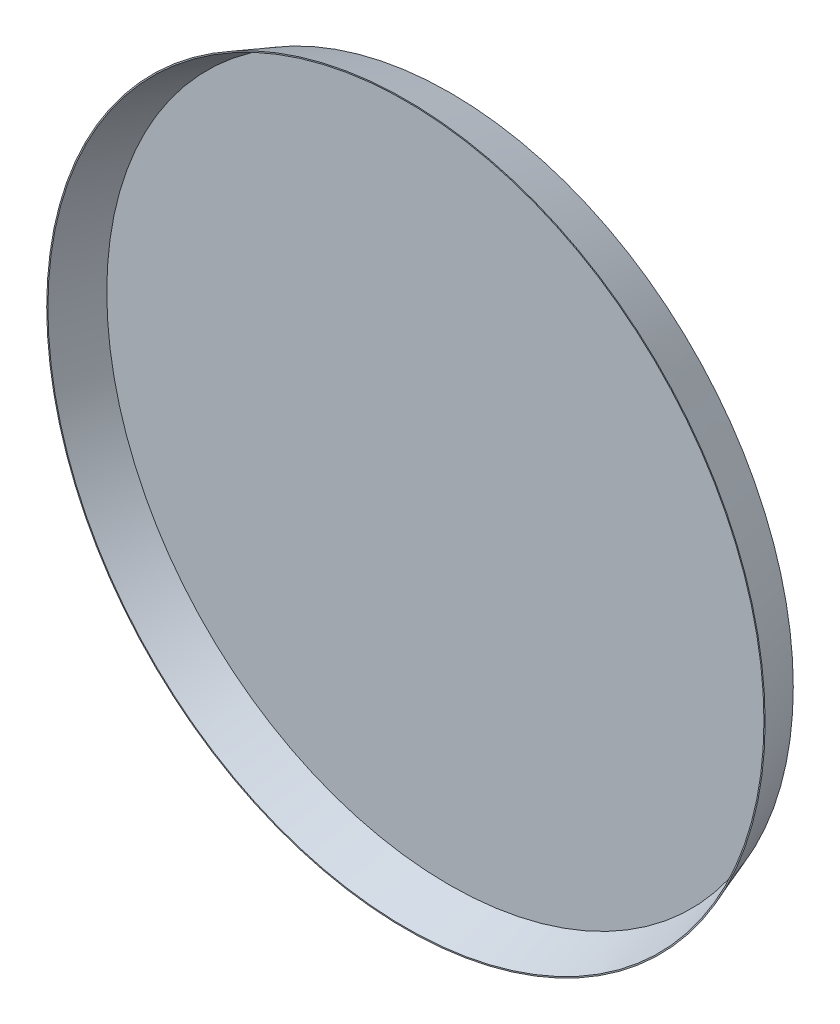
from build123d import *

# Parameters (mm, degrees)
SKETCH1_R          = 15.5
BASE_EXTRUDE_DEPTH = 2
BASE_EXTRUDE_DRAFT = -20
SHELL1_T           = -0.05


with BuildPart() as part:
    # Sketch1 → Base-Extrude (with draft: the straight prism first)
    with BuildSketch(Plane.XY):
        Circle(SKETCH1_R)
    extrude(amount=BASE_EXTRUDE_DEPTH)
    # Base-Extrude: the draft: its side faces are tilted about the plane it starts from
    base_extrude_sides = [part.faces().sort_by_distance(p)[0] for p in [
        (-15.5, 0, 1),
    ]]
    draft(base_extrude_sides, Plane.XY, BASE_EXTRUDE_DRAFT)

    # Shell1
    shell1_openings = [part.faces().sort_by_distance(p)[0] for p in [
        (0, 0, 2),
    ]]
    offset(amount=SHELL1_T, openings=shell1_openings, kind=Kind.INTERSECTION)


solid = part.part
